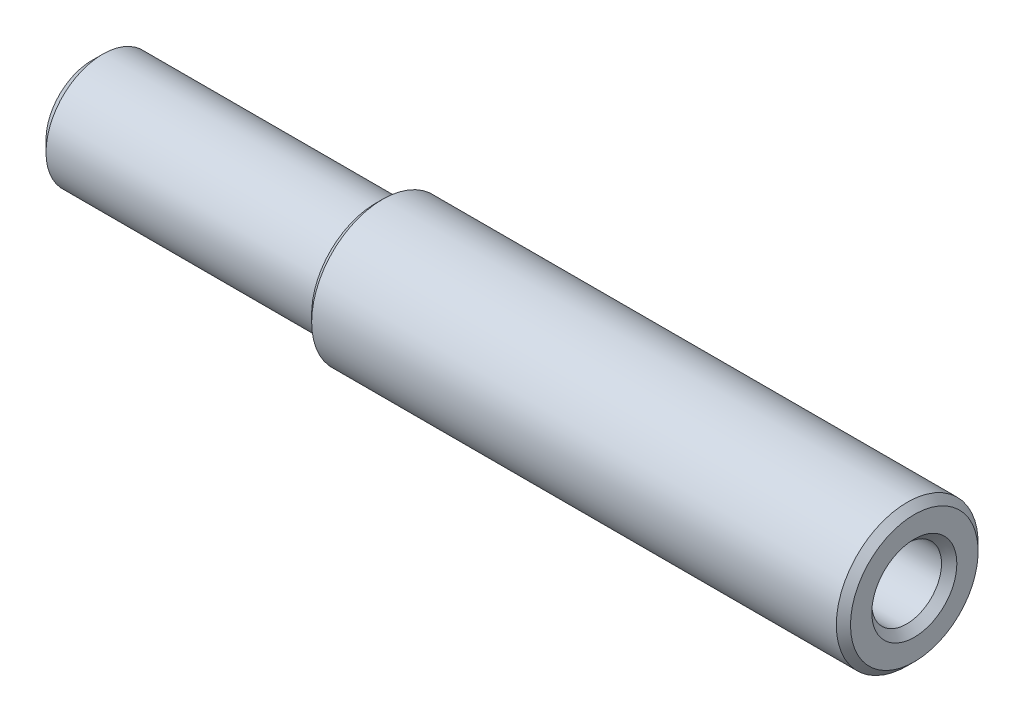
ISO-10303-21;
HEADER;
FILE_DESCRIPTION(('STEP AP214'),'2;1');
FILE_NAME('part.step','',(''),(''),'','','');
FILE_SCHEMA(('AUTOMOTIVE_DESIGN { 1 0 10303 214 1 1 1 1 }'));
ENDSEC;
DATA;
#1=APPLICATION_CONTEXT('core data for automotive mechanical design processes');
#2=APPLICATION_PROTOCOL_DEFINITION('international standard','automotive_design',2000,#1);
#3=PRODUCT_CONTEXT('',#1,'mechanical');
#4=PRODUCT('Part','Part','',(#3));
#5=PRODUCT_RELATED_PRODUCT_CATEGORY('part','',(#4));
#6=PRODUCT_DEFINITION_FORMATION('','',#4);
#7=PRODUCT_DEFINITION_CONTEXT('part definition',#1,'design');
#8=PRODUCT_DEFINITION('design','',#6,#7);
#9=PRODUCT_DEFINITION_SHAPE('','',#8);
#10=(LENGTH_UNIT() NAMED_UNIT(*) SI_UNIT(.MILLI.,.METRE.));
#11=(NAMED_UNIT(*) PLANE_ANGLE_UNIT() SI_UNIT($,.RADIAN.));
#12=(NAMED_UNIT(*) SI_UNIT($,.STERADIAN.) SOLID_ANGLE_UNIT());
#13=UNCERTAINTY_MEASURE_WITH_UNIT(LENGTH_MEASURE(1.E-05),#10,'distance_accuracy_value','');
#14=(GEOMETRIC_REPRESENTATION_CONTEXT(3) GLOBAL_UNCERTAINTY_ASSIGNED_CONTEXT((#13)) GLOBAL_UNIT_ASSIGNED_CONTEXT((#10,
#11,#12)) REPRESENTATION_CONTEXT('',''));
#15=CARTESIAN_POINT('',(0.,0.,0.));
#16=DIRECTION('',(0.,0.,1.));
#17=DIRECTION('',(1.,0.,0.));
#18=AXIS2_PLACEMENT_3D('',#15,#16,#17);
#19=CARTESIAN_POINT('',(-20.,0.,0.));
#20=DIRECTION('',(1.,0.,0.));
#21=DIRECTION('',(0.,0.,-1.));
#22=AXIS2_PLACEMENT_3D('',#19,#20,#21);
#23=PLANE('',#22);
#24=CARTESIAN_POINT('',(-19.9999999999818,0.,0.));
#25=DIRECTION('',(1.,0.,0.));
#26=DIRECTION('',(0.,0.,-1.));
#27=AXIS2_PLACEMENT_3D('',#24,#25,#26);
#28=CIRCLE('',#27,3.23300000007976);
#29=CARTESIAN_POINT('',(-19.9999999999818,0.,-3.23300000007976));
#30=VERTEX_POINT('',#29);
#31=EDGE_CURVE('E19',#30,#30,#28,.T.);
#32=ORIENTED_EDGE('',*,*,#31,.F.);
#33=EDGE_LOOP('',(#32));
#34=FACE_BOUND('',#33,.T.);
#35=ADVANCED_FACE('F16',(#34),#23,.F.);
#36=CARTESIAN_POINT('',(20.4194156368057,0.,0.));
#37=DIRECTION('',(1.,0.,0.));
#38=DIRECTION('',(0.,0.,-1.));
#39=AXIS2_PLACEMENT_3D('',#36,#37,#38);
#40=CONICAL_SURFACE('',#39,2.45849999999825,1.04719755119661);
#41=CARTESIAN_POINT('',(19.0000000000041,0.,0.));
#42=VERTEX_POINT('',#41);
#43=VERTEX_LOOP('',#42);
#44=FACE_BOUND('',#43,.T.);
#45=CARTESIAN_POINT('',(20.4194156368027,0.,0.));
#46=DIRECTION('',(-1.,0.,0.));
#47=DIRECTION('',(0.,0.,1.));
#48=AXIS2_PLACEMENT_3D('',#45,#46,#47);
#49=CIRCLE('',#48,2.4585);
#50=CARTESIAN_POINT('',(20.4194156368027,0.,2.4585));
#51=VERTEX_POINT('',#50);
#52=EDGE_CURVE('E33',#51,#51,#49,.F.);
#53=ORIENTED_EDGE('',*,*,#52,.T.);
#54=EDGE_LOOP('',(#53));
#55=FACE_BOUND('',#54,.T.);
#56=ADVANCED_FACE('F27',(#44,#55),#40,.F.);
#57=CARTESIAN_POINT('',(-19.2330000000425,0.,0.));
#58=DIRECTION('',(1.,0.,0.));
#59=DIRECTION('',(0.,0.,-1.));
#60=AXIS2_PLACEMENT_3D('',#57,#58,#59);
#61=CONICAL_SURFACE('',#60,4.0000000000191,0.785398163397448);
#62=ORIENTED_EDGE('',*,*,#31,.T.);
#63=EDGE_LOOP('',(#62));
#64=FACE_BOUND('',#63,.T.);
#65=CARTESIAN_POINT('',(-19.233,0.,0.));
#66=DIRECTION('',(-1.,0.,0.));
#67=DIRECTION('',(0.,0.,1.));
#68=AXIS2_PLACEMENT_3D('',#65,#66,#67);
#69=CIRCLE('',#68,4.);
#70=CARTESIAN_POINT('',(-19.233,0.,4.));
#71=VERTEX_POINT('',#70);
#72=EDGE_CURVE('E35',#71,#71,#69,.F.);
#73=ORIENTED_EDGE('',*,*,#72,.F.);
#74=EDGE_LOOP('',(#73));
#75=FACE_BOUND('',#74,.T.);
#76=ADVANCED_FACE('F30',(#64,#75),#61,.T.);
#77=CARTESIAN_POINT('',(38.,0.,0.));
#78=DIRECTION('',(-1.,0.,0.));
#79=DIRECTION('',(0.,0.,1.));
#80=AXIS2_PLACEMENT_3D('',#77,#78,#79);
#81=CYLINDRICAL_SURFACE('',#80,2.4585);
#82=ORIENTED_EDGE('',*,*,#52,.F.);
#83=EDGE_LOOP('',(#82));
#84=FACE_BOUND('',#83,.T.);
#85=CARTESIAN_POINT('',(37.4585000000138,0.,0.));
#86=DIRECTION('',(1.,0.,0.));
#87=DIRECTION('',(0.,0.,-1.));
#88=AXIS2_PLACEMENT_3D('',#85,#86,#87);
#89=CIRCLE('',#88,2.45849999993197);
#90=CARTESIAN_POINT('',(37.4585000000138,0.,-2.45849999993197));
#91=VERTEX_POINT('',#90);
#92=EDGE_CURVE('E38',#91,#91,#89,.T.);
#93=ORIENTED_EDGE('',*,*,#92,.T.);
#94=EDGE_LOOP('',(#93));
#95=FACE_BOUND('',#94,.T.);
#96=ADVANCED_FACE('F97',(#84,#95),#81,.F.);
#97=CARTESIAN_POINT('',(38.,0.,0.));
#98=DIRECTION('',(-1.,0.,0.));
#99=DIRECTION('',(0.,0.,1.));
#100=AXIS2_PLACEMENT_3D('',#97,#98,#99);
#101=CYLINDRICAL_SURFACE('',#100,4.);
#102=ORIENTED_EDGE('',*,*,#72,.T.);
#103=EDGE_LOOP('',(#102));
#104=FACE_BOUND('',#103,.T.);
#105=CARTESIAN_POINT('',(-0.300000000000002,0.,0.));
#106=DIRECTION('',(1.,0.,0.));
#107=DIRECTION('',(0.,0.,-1.));
#108=AXIS2_PLACEMENT_3D('',#105,#106,#107);
#109=CIRCLE('',#108,4.);
#110=CARTESIAN_POINT('',(-0.300000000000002,0.,-4.));
#111=VERTEX_POINT('',#110);
#112=EDGE_CURVE('E54',#111,#111,#109,.F.);
#113=ORIENTED_EDGE('',*,*,#112,.T.);
#114=EDGE_LOOP('',(#113));
#115=FACE_BOUND('',#114,.T.);
#116=ADVANCED_FACE('F93',(#104,#115),#101,.T.);
#117=CARTESIAN_POINT('',(37.9999999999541,0.,0.));
#118=DIRECTION('',(1.,0.,0.));
#119=DIRECTION('',(0.,0.,-1.));
#120=AXIS2_PLACEMENT_3D('',#117,#118,#119);
#121=CONICAL_SURFACE('',#120,2.99999999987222,0.785398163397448);
#122=ORIENTED_EDGE('',*,*,#92,.F.);
#123=EDGE_LOOP('',(#122));
#124=FACE_BOUND('',#123,.T.);
#125=CARTESIAN_POINT('',(38.0000000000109,0.,0.));
#126=DIRECTION('',(1.,0.,0.));
#127=DIRECTION('',(0.,0.,-1.));
#128=AXIS2_PLACEMENT_3D('',#125,#126,#127);
#129=CIRCLE('',#128,2.99999999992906);
#130=CARTESIAN_POINT('',(38.0000000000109,0.,-2.99999999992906));
#131=VERTEX_POINT('',#130);
#132=EDGE_CURVE('E52',#131,#131,#129,.T.);
#133=ORIENTED_EDGE('',*,*,#132,.T.);
#134=EDGE_LOOP('',(#133));
#135=FACE_BOUND('',#134,.T.);
#136=ADVANCED_FACE('F88',(#124,#135),#121,.F.);
#137=CARTESIAN_POINT('',(-0.300000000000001,0.,0.));
#138=DIRECTION('',(1.,0.,0.));
#139=DIRECTION('',(0.,0.,-1.));
#140=AXIS2_PLACEMENT_3D('',#137,#138,#139);
#141=TOROIDAL_SURFACE('',#140,4.3,0.300000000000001);
#142=ORIENTED_EDGE('',*,*,#112,.F.);
#143=EDGE_LOOP('',(#142));
#144=FACE_BOUND('',#143,.T.);
#145=CARTESIAN_POINT('',(0.,0.,0.));
#146=DIRECTION('',(-1.,0.,0.));
#147=DIRECTION('',(0.,0.,-1.));
#148=AXIS2_PLACEMENT_3D('',#145,#146,#147);
#149=CIRCLE('',#148,4.3);
#150=CARTESIAN_POINT('',(0.,0.,-4.3));
#151=VERTEX_POINT('',#150);
#152=EDGE_CURVE('E51',#151,#151,#149,.T.);
#153=ORIENTED_EDGE('',*,*,#152,.T.);
#154=EDGE_LOOP('',(#153));
#155=FACE_BOUND('',#154,.T.);
#156=ADVANCED_FACE('F77',(#144,#155),#141,.F.);
#157=CARTESIAN_POINT('',(38.,4.5,0.));
#158=DIRECTION('',(-1.,0.,0.));
#159=DIRECTION('',(0.,0.,1.));
#160=AXIS2_PLACEMENT_3D('',#157,#158,#159);
#161=PLANE('',#160);
#162=CARTESIAN_POINT('',(38.0000000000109,0.,0.));
#163=DIRECTION('',(-1.,0.,0.));
#164=DIRECTION('',(0.,0.,1.));
#165=AXIS2_PLACEMENT_3D('',#162,#163,#164);
#166=CIRCLE('',#165,4.49999999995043);
#167=CARTESIAN_POINT('',(38.0000000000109,0.,4.49999999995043));
#168=VERTEX_POINT('',#167);
#169=EDGE_CURVE('E49',#168,#168,#166,.T.);
#170=ORIENTED_EDGE('',*,*,#169,.F.);
#171=EDGE_LOOP('',(#170));
#172=FACE_BOUND('',#171,.T.);
#173=ORIENTED_EDGE('',*,*,#132,.F.);
#174=EDGE_LOOP('',(#173));
#175=FACE_BOUND('',#174,.T.);
#176=ADVANCED_FACE('F87',(#172,#175),#161,.F.);
#177=CARTESIAN_POINT('',(0.,4.3,0.));
#178=DIRECTION('',(1.,0.,0.));
#179=DIRECTION('',(0.,0.,-1.));
#180=AXIS2_PLACEMENT_3D('',#177,#178,#179);
#181=PLANE('',#180);
#182=ORIENTED_EDGE('',*,*,#152,.F.);
#183=EDGE_LOOP('',(#182));
#184=FACE_BOUND('',#183,.T.);
#185=CARTESIAN_POINT('',(0.,0.,0.));
#186=DIRECTION('',(1.,0.,0.));
#187=DIRECTION('',(0.,0.,-1.));
#188=AXIS2_PLACEMENT_3D('',#185,#186,#187);
#189=CIRCLE('',#188,4.49999999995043);
#190=CARTESIAN_POINT('',(0.,0.,-4.49999999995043));
#191=VERTEX_POINT('',#190);
#192=EDGE_CURVE('E46',#191,#191,#189,.T.);
#193=ORIENTED_EDGE('',*,*,#192,.F.);
#194=EDGE_LOOP('',(#193));
#195=FACE_BOUND('',#194,.T.);
#196=ADVANCED_FACE('F121',(#184,#195),#181,.F.);
#197=CARTESIAN_POINT('',(37.5000000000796,0.,0.));
#198=DIRECTION('',(-1.,0.,0.));
#199=DIRECTION('',(0.,0.,1.));
#200=AXIS2_PLACEMENT_3D('',#197,#198,#199);
#201=CONICAL_SURFACE('',#200,4.99999999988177,0.785398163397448);
#202=CARTESIAN_POINT('',(37.5,0.,0.));
#203=DIRECTION('',(-1.,0.,0.));
#204=DIRECTION('',(0.,0.,1.));
#205=AXIS2_PLACEMENT_3D('',#202,#203,#204);
#206=CIRCLE('',#205,5.);
#207=CARTESIAN_POINT('',(37.5,0.,5.));
#208=VERTEX_POINT('',#207);
#209=EDGE_CURVE('E23',#208,#208,#206,.T.);
#210=ORIENTED_EDGE('',*,*,#209,.F.);
#211=EDGE_LOOP('',(#210));
#212=FACE_BOUND('',#211,.T.);
#213=ORIENTED_EDGE('',*,*,#169,.T.);
#214=EDGE_LOOP('',(#213));
#215=FACE_BOUND('',#214,.T.);
#216=ADVANCED_FACE('F115',(#212,#215),#201,.T.);
#217=CARTESIAN_POINT('',(0.499999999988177,0.,0.));
#218=DIRECTION('',(1.,0.,0.));
#219=DIRECTION('',(0.,0.,-1.));
#220=AXIS2_PLACEMENT_3D('',#217,#218,#219);
#221=CONICAL_SURFACE('',#220,4.99999999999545,0.785398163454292);
#222=ORIENTED_EDGE('',*,*,#192,.T.);
#223=EDGE_LOOP('',(#222));
#224=FACE_BOUND('',#223,.T.);
#225=CARTESIAN_POINT('',(0.5,0.,0.));
#226=DIRECTION('',(-1.,0.,0.));
#227=DIRECTION('',(0.,0.,1.));
#228=AXIS2_PLACEMENT_3D('',#225,#226,#227);
#229=CIRCLE('',#228,5.);
#230=CARTESIAN_POINT('',(0.5,0.,5.));
#231=VERTEX_POINT('',#230);
#232=EDGE_CURVE('E11',#231,#231,#229,.F.);
#233=ORIENTED_EDGE('',*,*,#232,.F.);
#234=EDGE_LOOP('',(#233));
#235=FACE_BOUND('',#234,.T.);
#236=ADVANCED_FACE('F109',(#224,#235),#221,.T.);
#237=CARTESIAN_POINT('',(38.,0.,0.));
#238=DIRECTION('',(-1.,0.,0.));
#239=DIRECTION('',(0.,0.,1.));
#240=AXIS2_PLACEMENT_3D('',#237,#238,#239);
#241=CYLINDRICAL_SURFACE('',#240,5.);
#242=ORIENTED_EDGE('',*,*,#232,.T.);
#243=EDGE_LOOP('',(#242));
#244=FACE_BOUND('',#243,.T.);
#245=ORIENTED_EDGE('',*,*,#209,.T.);
#246=EDGE_LOOP('',(#245));
#247=FACE_BOUND('',#246,.T.);
#248=ADVANCED_FACE('F107',(#244,#247),#241,.T.);
#249=CLOSED_SHELL('',(#35,#56,#76,#96,#116,#136,#156,#176,#196,#216,#236,#248));
#250=MANIFOLD_SOLID_BREP('B1',#249);
#251=ADVANCED_BREP_SHAPE_REPRESENTATION('',(#18,#250),#14);
#252=SHAPE_DEFINITION_REPRESENTATION(#9,#251);
ENDSEC;
END-ISO-10303-21;
